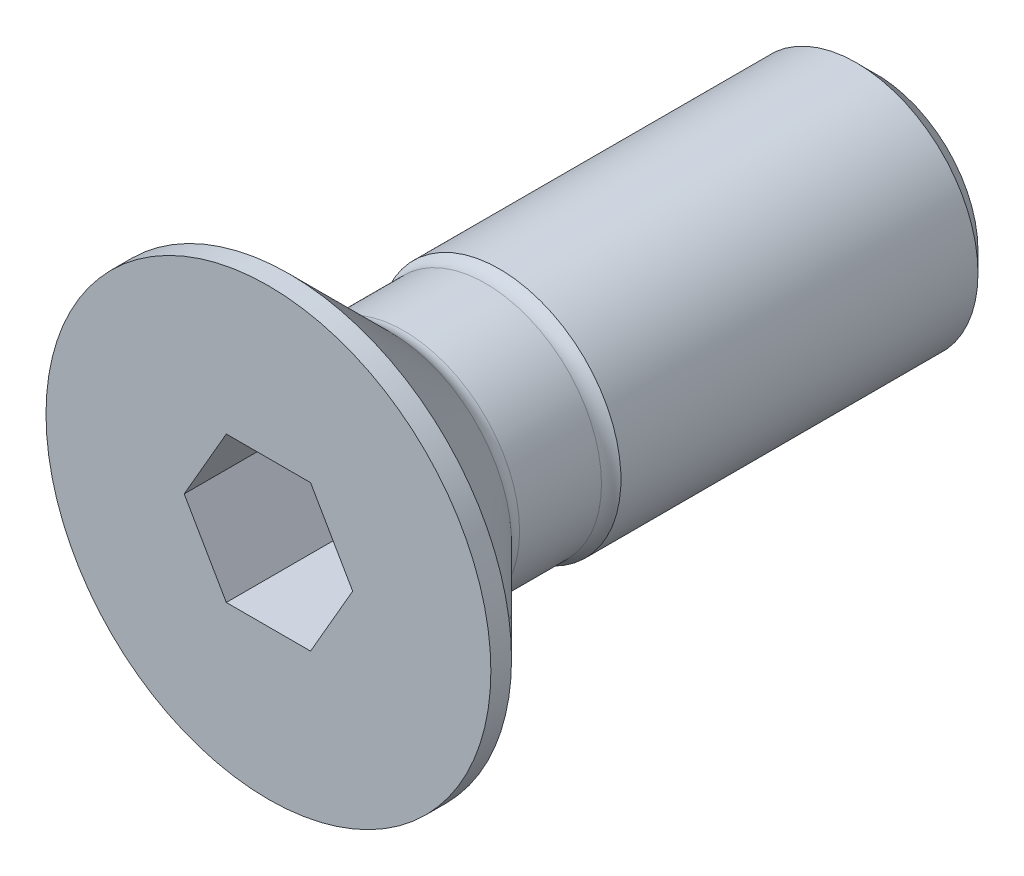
ISO-10303-21;
HEADER;
FILE_DESCRIPTION(('STEP AP214'),'2;1');
FILE_NAME('part.step','',(''),(''),'','','');
FILE_SCHEMA(('AUTOMOTIVE_DESIGN { 1 0 10303 214 1 1 1 1 }'));
ENDSEC;
DATA;
#1=APPLICATION_CONTEXT('core data for automotive mechanical design processes');
#2=APPLICATION_PROTOCOL_DEFINITION('international standard','automotive_design',2000,#1);
#3=PRODUCT_CONTEXT('',#1,'mechanical');
#4=PRODUCT('Part','Part','',(#3));
#5=PRODUCT_RELATED_PRODUCT_CATEGORY('part','',(#4));
#6=PRODUCT_DEFINITION_FORMATION('','',#4);
#7=PRODUCT_DEFINITION_CONTEXT('part definition',#1,'design');
#8=PRODUCT_DEFINITION('design','',#6,#7);
#9=PRODUCT_DEFINITION_SHAPE('','',#8);
#10=(LENGTH_UNIT() NAMED_UNIT(*) SI_UNIT(.MILLI.,.METRE.));
#11=(NAMED_UNIT(*) PLANE_ANGLE_UNIT() SI_UNIT($,.RADIAN.));
#12=(NAMED_UNIT(*) SI_UNIT($,.STERADIAN.) SOLID_ANGLE_UNIT());
#13=UNCERTAINTY_MEASURE_WITH_UNIT(LENGTH_MEASURE(1.E-05),#10,'distance_accuracy_value','');
#14=(GEOMETRIC_REPRESENTATION_CONTEXT(3) GLOBAL_UNCERTAINTY_ASSIGNED_CONTEXT((#13)) GLOBAL_UNIT_ASSIGNED_CONTEXT((#10,
#11,#12)) REPRESENTATION_CONTEXT('',''));
#15=CARTESIAN_POINT('',(0.,0.,0.));
#16=DIRECTION('',(0.,0.,1.));
#17=DIRECTION('',(1.,0.,0.));
#18=AXIS2_PLACEMENT_3D('',#15,#16,#17);
#19=CARTESIAN_POINT('',(0.,2.0940625,-25.));
#20=DIRECTION('',(0.,0.,-1.));
#21=DIRECTION('',(-1.,0.,0.));
#22=AXIS2_PLACEMENT_3D('',#19,#20,#21);
#23=PLANE('',#22);
#24=CARTESIAN_POINT('',(0.,0.,-24.9999999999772));
#25=DIRECTION('',(0.,0.,1.));
#26=DIRECTION('',(1.,0.,0.));
#27=AXIS2_PLACEMENT_3D('',#24,#25,#26);
#28=CIRCLE('',#27,4.18812499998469);
#29=CARTESIAN_POINT('',(4.18812499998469,0.,-24.9999999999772));
#30=VERTEX_POINT('',#29);
#31=EDGE_CURVE('E20',#30,#30,#28,.T.);
#32=ORIENTED_EDGE('',*,*,#31,.F.);
#33=EDGE_LOOP('',(#32));
#34=FACE_BOUND('',#33,.T.);
#35=ADVANCED_FACE('F16',(#34),#23,.T.);
#36=CARTESIAN_POINT('',(0.,0.,-24.1881250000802));
#37=DIRECTION('',(0.,0.,1.));
#38=DIRECTION('',(1.,0.,0.));
#39=AXIS2_PLACEMENT_3D('',#36,#37,#38);
#40=CONICAL_SURFACE('',#39,4.99999999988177,0.785398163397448);
#41=ORIENTED_EDGE('',*,*,#31,.T.);
#42=EDGE_LOOP('',(#41));
#43=FACE_BOUND('',#42,.T.);
#44=CARTESIAN_POINT('',(0.,0.,-24.188125));
#45=DIRECTION('',(0.,0.,-1.));
#46=DIRECTION('',(-1.,0.,0.));
#47=AXIS2_PLACEMENT_3D('',#44,#45,#46);
#48=CIRCLE('',#47,5.);
#49=CARTESIAN_POINT('',(-5.,0.,-24.188125));
#50=VERTEX_POINT('',#49);
#51=EDGE_CURVE('E154',#50,#50,#48,.F.);
#52=ORIENTED_EDGE('',*,*,#51,.F.);
#53=EDGE_LOOP('',(#52));
#54=FACE_BOUND('',#53,.T.);
#55=ADVANCED_FACE('F318',(#43,#54),#40,.T.);
#56=CARTESIAN_POINT('',(0.,0.,-16.8440625));
#57=DIRECTION('',(0.,0.,-1.));
#58=DIRECTION('',(-1.,0.,0.));
#59=AXIS2_PLACEMENT_3D('',#56,#57,#58);
#60=CYLINDRICAL_SURFACE('',#59,5.);
#61=ORIENTED_EDGE('',*,*,#51,.T.);
#62=EDGE_LOOP('',(#61));
#63=FACE_BOUND('',#62,.T.);
#64=CARTESIAN_POINT('',(0.,0.,-9.5));
#65=DIRECTION('',(0.,0.,-1.));
#66=DIRECTION('',(-1.,0.,0.));
#67=AXIS2_PLACEMENT_3D('',#64,#65,#66);
#68=CIRCLE('',#67,5.);
#69=CARTESIAN_POINT('',(-5.,0.,-9.5));
#70=VERTEX_POINT('',#69);
#71=EDGE_CURVE('E156',#70,#70,#68,.F.);
#72=ORIENTED_EDGE('',*,*,#71,.F.);
#73=EDGE_LOOP('',(#72));
#74=FACE_BOUND('',#73,.T.);
#75=ADVANCED_FACE('F260',(#63,#74),#60,.T.);
#76=CARTESIAN_POINT('',(0.,0.,-8.93431457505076));
#77=DIRECTION('',(0.,0.,-1.));
#78=DIRECTION('',(-1.,0.,0.));
#79=AXIS2_PLACEMENT_3D('',#76,#77,#78);
#80=TOROIDAL_SURFACE('',#79,5.56568542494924,0.8);
#81=CARTESIAN_POINT('',(0.,0.,-8.93431457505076));
#82=DIRECTION('',(0.,0.,-1.));
#83=DIRECTION('',(-1.,0.,0.));
#84=AXIS2_PLACEMENT_3D('',#81,#82,#83);
#85=CIRCLE('',#84,4.76568542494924);
#86=CARTESIAN_POINT('',(-4.76568542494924,0.,-8.93431457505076));
#87=VERTEX_POINT('',#86);
#88=EDGE_CURVE('E246',#87,#87,#85,.F.);
#89=ORIENTED_EDGE('',*,*,#88,.F.);
#90=EDGE_LOOP('',(#89));
#91=FACE_BOUND('',#90,.T.);
#92=ORIENTED_EDGE('',*,*,#71,.T.);
#93=EDGE_LOOP('',(#92));
#94=FACE_BOUND('',#93,.T.);
#95=ADVANCED_FACE('F257',(#91,#94),#80,.F.);
#96=CARTESIAN_POINT('',(0.,0.,-7.25));
#97=DIRECTION('',(0.,0.,-1.));
#98=DIRECTION('',(-1.,0.,0.));
#99=AXIS2_PLACEMENT_3D('',#96,#97,#98);
#100=CYLINDRICAL_SURFACE('',#99,4.76568542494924);
#101=ORIENTED_EDGE('',*,*,#88,.T.);
#102=EDGE_LOOP('',(#101));
#103=FACE_BOUND('',#102,.T.);
#104=CARTESIAN_POINT('',(0.,0.,-5.56568542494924));
#105=DIRECTION('',(0.,0.,-1.));
#106=DIRECTION('',(-1.,0.,0.));
#107=AXIS2_PLACEMENT_3D('',#104,#105,#106);
#108=CIRCLE('',#107,4.76568542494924);
#109=CARTESIAN_POINT('',(-4.76568542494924,0.,-5.56568542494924));
#110=VERTEX_POINT('',#109);
#111=EDGE_CURVE('E99',#110,#110,#108,.F.);
#112=ORIENTED_EDGE('',*,*,#111,.F.);
#113=EDGE_LOOP('',(#112));
#114=FACE_BOUND('',#113,.T.);
#115=ADVANCED_FACE('F242',(#103,#114),#100,.T.);
#116=CARTESIAN_POINT('',(0.,0.,-5.56568542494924));
#117=DIRECTION('',(0.,0.,-1.));
#118=DIRECTION('',(-1.,0.,0.));
#119=AXIS2_PLACEMENT_3D('',#116,#117,#118);
#120=TOROIDAL_SURFACE('',#119,5.56568542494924,0.8);
#121=CARTESIAN_POINT('',(0.,0.,-5.));
#122=DIRECTION('',(0.,0.,1.));
#123=DIRECTION('',(0.,1.,0.));
#124=AXIS2_PLACEMENT_3D('',#121,#122,#123);
#125=CIRCLE('',#124,5.);
#126=CARTESIAN_POINT('',(0.,5.,-5.));
#127=VERTEX_POINT('',#126);
#128=EDGE_CURVE('E81',#127,#127,#125,.T.);
#129=ORIENTED_EDGE('',*,*,#128,.F.);
#130=EDGE_LOOP('',(#129));
#131=FACE_BOUND('',#130,.T.);
#132=ORIENTED_EDGE('',*,*,#111,.T.);
#133=EDGE_LOOP('',(#132));
#134=FACE_BOUND('',#133,.T.);
#135=ADVANCED_FACE('F176',(#131,#134),#120,.F.);
#136=CARTESIAN_POINT('',(0.,0.,-4.48799688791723));
#137=DIRECTION('',(0.,0.,1.));
#138=DIRECTION('',(1.,0.,0.));
#139=AXIS2_PLACEMENT_3D('',#136,#137,#138);
#140=CONICAL_SURFACE('',#139,3.48578999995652,1.04719755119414);
#141=CARTESIAN_POINT('',(3.46499999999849,2.61771186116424E-12,-4.49999999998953));
#142=CARTESIAN_POINT('',(3.38886711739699,0.131866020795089,-4.543968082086));
#143=CARTESIAN_POINT('',(3.31207705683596,0.264870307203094,-4.58395475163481));
#144=CARTESIAN_POINT('',(3.15716736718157,0.533181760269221,-4.65375028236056));
#145=CARTESIAN_POINT('',(3.0790449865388,0.668493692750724,-4.68353445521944));
#146=CARTESIAN_POINT('',(2.92376835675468,0.937440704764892,-4.72989566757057));
#147=CARTESIAN_POINT('',(2.84663799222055,1.0710344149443,-4.74678130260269));
#148=CARTESIAN_POINT('',(2.69201452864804,1.33885010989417,-4.76693545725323));
#149=CARTESIAN_POINT('',(2.61452199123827,1.47307112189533,-4.77022067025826));
#150=CARTESIAN_POINT('',(2.46973549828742,1.72384868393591,-4.76336884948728));
#151=CARTESIAN_POINT('',(2.40241981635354,1.84044286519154,-4.75491416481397));
#152=CARTESIAN_POINT('',(2.26822699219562,2.07287165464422,-4.72812319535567));
#153=CARTESIAN_POINT('',(2.2013503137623,2.18870545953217,-4.70977776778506));
#154=CARTESIAN_POINT('',(2.06688103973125,2.42161307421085,-4.66391774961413));
#155=CARTESIAN_POINT('',(1.99930545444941,2.53865742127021,-4.63620885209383));
#156=CARTESIAN_POINT('',(1.86516188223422,2.77100090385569,-4.57332136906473));
#157=CARTESIAN_POINT('',(1.79859217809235,2.88630301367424,-4.53815755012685));
#158=CARTESIAN_POINT('',(1.73250000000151,3.00077802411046,-4.49999999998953));
#159=B_SPLINE_CURVE_WITH_KNOTS('',3,(#141,#142,#143,#144,#145,#146,#147,#148,#149,#150,#151,
#152,#153,#154,#155,#156,#157,#158),.UNSPECIFIED.,.F.,.F.,(4,2,2,2,2,2,2,2,4),(0.,
0.475647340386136,0.952437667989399,1.41742891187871,1.88184924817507,2.28615441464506,
2.69083395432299,3.1044873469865,3.51732891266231),.UNSPECIFIED.);
#160=CARTESIAN_POINT('',(3.46499999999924,-1.30917788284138E-12,-4.49999999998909));
#161=VERTEX_POINT('',#160);
#162=CARTESIAN_POINT('',(1.73249999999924,3.00077802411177,-4.49999999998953));
#163=VERTEX_POINT('',#162);
#164=EDGE_CURVE('E117',#161,#163,#159,.T.);
#165=ORIENTED_EDGE('',*,*,#164,.T.);
#166=CARTESIAN_POINT('',(1.73249999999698,3.00077802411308,-4.49999999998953));
#167=CARTESIAN_POINT('',(1.59027892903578,3.00077802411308,-4.5410599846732));
#168=CARTESIAN_POINT('',(1.44693276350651,3.00077802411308,-4.57865156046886));
#169=CARTESIAN_POINT('',(1.15791187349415,3.00077802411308,-4.64509000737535));
#170=CARTESIAN_POINT('',(1.01223269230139,3.00077802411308,-4.67391731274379));
#171=CARTESIAN_POINT('',(0.722508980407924,3.00077802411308,-4.72027510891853));
#172=CARTESIAN_POINT('',(0.578505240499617,3.00077802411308,-4.73805276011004));
#173=CARTESIAN_POINT('',(0.289666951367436,3.00077802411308,-4.76191820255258));
#174=CARTESIAN_POINT('',(0.144833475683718,3.00077802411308,-4.76801868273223));
#175=CARTESIAN_POINT('',(-0.144833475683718,3.00077802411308,-4.76801868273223));
#176=CARTESIAN_POINT('',(-0.289666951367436,3.00077802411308,-4.76191820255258));
#177=CARTESIAN_POINT('',(-0.578505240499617,3.00077802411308,-4.73805276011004));
#178=CARTESIAN_POINT('',(-0.722508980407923,3.00077802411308,-4.72027510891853));
#179=CARTESIAN_POINT('',(-1.01223269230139,3.00077802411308,-4.67391731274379));
#180=CARTESIAN_POINT('',(-1.15791187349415,3.00077802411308,-4.64509000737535));
#181=CARTESIAN_POINT('',(-1.44693276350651,3.00077802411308,-4.57865156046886));
#182=CARTESIAN_POINT('',(-1.59027892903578,3.00077802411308,-4.5410599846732));
#183=CARTESIAN_POINT('',(-1.73249999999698,3.00077802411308,-4.49999999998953));
#184=B_SPLINE_CURVE_WITH_KNOTS('',3,(#166,#167,#168,#169,#170,#171,#172,#173,#174,#175,#176,
#177,#178,#179,#180,#181,#182,#183),.UNSPECIFIED.,.F.,.F.,(4,2,2,2,2,2,2,2,4),(0.,
0.444225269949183,0.8894350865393,1.32428964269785,1.7586713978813,2.19305315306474,
2.62790770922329,3.07311752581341,3.51734279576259),.UNSPECIFIED.);
#185=CARTESIAN_POINT('',(-1.73249999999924,3.00077802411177,-4.49999999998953));
#186=VERTEX_POINT('',#185);
#187=EDGE_CURVE('E113',#163,#186,#184,.T.);
#188=ORIENTED_EDGE('',*,*,#187,.T.);
#189=CARTESIAN_POINT('',(-1.73250000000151,3.00077802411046,-4.49999999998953));
#190=CARTESIAN_POINT('',(-1.80863288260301,2.86891200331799,-4.543968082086));
#191=CARTESIAN_POINT('',(-1.88542294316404,2.73590771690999,-4.58395475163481));
#192=CARTESIAN_POINT('',(-2.04033263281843,2.46759626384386,-4.65375028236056));
#193=CARTESIAN_POINT('',(-2.1184550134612,2.33228433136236,-4.68353445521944));
#194=CARTESIAN_POINT('',(-2.27373164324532,2.06333731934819,-4.72989566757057));
#195=CARTESIAN_POINT('',(-2.35086200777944,1.92974360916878,-4.74678130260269));
#196=CARTESIAN_POINT('',(-2.50548547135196,1.66192791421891,-4.76693545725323));
#197=CARTESIAN_POINT('',(-2.58297800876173,1.52770690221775,-4.77022067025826));
#198=CARTESIAN_POINT('',(-2.72776450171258,1.27692934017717,-4.76336884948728));
#199=CARTESIAN_POINT('',(-2.79508018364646,1.16033515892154,-4.75491416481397));
#200=CARTESIAN_POINT('',(-2.92927300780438,0.927906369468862,-4.72812319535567));
#201=CARTESIAN_POINT('',(-2.9961496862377,0.81207256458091,-4.70977776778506));
#202=CARTESIAN_POINT('',(-3.13061896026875,0.57916494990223,-4.66391774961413));
#203=CARTESIAN_POINT('',(-3.19819454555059,0.462120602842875,-4.63620885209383));
#204=CARTESIAN_POINT('',(-3.33233811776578,0.229777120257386,-4.57332136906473));
#205=CARTESIAN_POINT('',(-3.39890782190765,0.114475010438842,-4.53815755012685));
#206=CARTESIAN_POINT('',(-3.46499999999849,2.61811792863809E-12,-4.49999999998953));
#207=B_SPLINE_CURVE_WITH_KNOTS('',3,(#189,#190,#191,#192,#193,#194,#195,#196,#197,#198,#199,
#200,#201,#202,#203,#204,#205,#206),.UNSPECIFIED.,.F.,.F.,(4,2,2,2,2,2,2,2,4),(0.,
0.475647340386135,0.952437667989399,1.41742891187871,1.88184924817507,2.28615441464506,
2.69083395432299,3.1044873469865,3.51732891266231),.UNSPECIFIED.);
#208=CARTESIAN_POINT('',(-3.46499999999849,0.,-4.49999999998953));
#209=VERTEX_POINT('',#208);
#210=EDGE_CURVE('E108',#186,#209,#207,.T.);
#211=ORIENTED_EDGE('',*,*,#210,.T.);
#212=CARTESIAN_POINT('',(-3.46499999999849,-2.61766510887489E-12,-4.49999999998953));
#213=CARTESIAN_POINT('',(-3.38886711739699,-0.131866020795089,-4.543968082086));
#214=CARTESIAN_POINT('',(-3.31207705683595,-0.264870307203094,-4.58395475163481));
#215=CARTESIAN_POINT('',(-3.15716736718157,-0.53318176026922,-4.65375028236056));
#216=CARTESIAN_POINT('',(-3.0790449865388,-0.668493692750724,-4.68353445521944));
#217=CARTESIAN_POINT('',(-2.92376835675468,-0.937440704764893,-4.72989566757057));
#218=CARTESIAN_POINT('',(-2.84663799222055,-1.0710344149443,-4.74678130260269));
#219=CARTESIAN_POINT('',(-2.69201452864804,-1.33885010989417,-4.76693545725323));
#220=CARTESIAN_POINT('',(-2.61452199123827,-1.47307112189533,-4.77022067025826));
#221=CARTESIAN_POINT('',(-2.46973549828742,-1.72384868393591,-4.76336884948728));
#222=CARTESIAN_POINT('',(-2.40241981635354,-1.84044286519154,-4.75491416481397));
#223=CARTESIAN_POINT('',(-2.26822699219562,-2.07287165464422,-4.72812319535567));
#224=CARTESIAN_POINT('',(-2.2013503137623,-2.18870545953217,-4.70977776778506));
#225=CARTESIAN_POINT('',(-2.06688103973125,-2.42161307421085,-4.66391774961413));
#226=CARTESIAN_POINT('',(-1.99930545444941,-2.5386574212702,-4.63620885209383));
#227=CARTESIAN_POINT('',(-1.86516188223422,-2.77100090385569,-4.57332136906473));
#228=CARTESIAN_POINT('',(-1.79859217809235,-2.88630301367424,-4.53815755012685));
#229=CARTESIAN_POINT('',(-1.73250000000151,-3.00077802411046,-4.49999999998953));
#230=B_SPLINE_CURVE_WITH_KNOTS('',3,(#212,#213,#214,#215,#216,#217,#218,#219,#220,#221,#222,
#223,#224,#225,#226,#227,#228,#229),.UNSPECIFIED.,.F.,.F.,(4,2,2,2,2,2,2,2,4),(0.,
0.475647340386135,0.952437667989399,1.41742891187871,1.88184924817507,2.28615441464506,
2.69083395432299,3.10448734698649,3.51732891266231),.UNSPECIFIED.);
#231=CARTESIAN_POINT('',(-1.73249999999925,-3.00077802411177,-4.49999999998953));
#232=VERTEX_POINT('',#231);
#233=EDGE_CURVE('E87',#209,#232,#230,.T.);
#234=ORIENTED_EDGE('',*,*,#233,.T.);
#235=CARTESIAN_POINT('',(-1.73249999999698,-3.00077802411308,-4.49999999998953));
#236=CARTESIAN_POINT('',(-1.59027892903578,-3.00077802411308,-4.5410599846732));
#237=CARTESIAN_POINT('',(-1.44693276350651,-3.00077802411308,-4.57865156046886));
#238=CARTESIAN_POINT('',(-1.15791187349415,-3.00077802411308,-4.64509000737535));
#239=CARTESIAN_POINT('',(-1.01223269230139,-3.00077802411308,-4.67391731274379));
#240=CARTESIAN_POINT('',(-0.722508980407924,-3.00077802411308,-4.72027510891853));
#241=CARTESIAN_POINT('',(-0.578505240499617,-3.00077802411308,-4.73805276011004));
#242=CARTESIAN_POINT('',(-0.289666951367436,-3.00077802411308,-4.76191820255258));
#243=CARTESIAN_POINT('',(-0.144833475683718,-3.00077802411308,-4.76801868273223));
#244=CARTESIAN_POINT('',(0.144833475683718,-3.00077802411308,-4.76801868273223));
#245=CARTESIAN_POINT('',(0.289666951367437,-3.00077802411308,-4.76191820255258));
#246=CARTESIAN_POINT('',(0.578505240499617,-3.00077802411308,-4.73805276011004));
#247=CARTESIAN_POINT('',(0.722508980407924,-3.00077802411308,-4.72027510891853));
#248=CARTESIAN_POINT('',(1.01223269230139,-3.00077802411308,-4.67391731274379));
#249=CARTESIAN_POINT('',(1.15791187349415,-3.00077802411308,-4.64509000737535));
#250=CARTESIAN_POINT('',(1.44693276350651,-3.00077802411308,-4.57865156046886));
#251=CARTESIAN_POINT('',(1.59027892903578,-3.00077802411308,-4.5410599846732));
#252=CARTESIAN_POINT('',(1.73249999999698,-3.00077802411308,-4.49999999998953));
#253=B_SPLINE_CURVE_WITH_KNOTS('',3,(#235,#236,#237,#238,#239,#240,#241,#242,#243,#244,#245,
#246,#247,#248,#249,#250,#251,#252),.UNSPECIFIED.,.F.,.F.,(4,2,2,2,2,2,2,2,4),(0.,
0.444225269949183,0.8894350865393,1.32428964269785,1.7586713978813,2.19305315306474,
2.62790770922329,3.07311752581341,3.51734279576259),.UNSPECIFIED.);
#254=CARTESIAN_POINT('',(1.73249999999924,-3.00077802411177,-4.49999999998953));
#255=VERTEX_POINT('',#254);
#256=EDGE_CURVE('E83',#232,#255,#253,.T.);
#257=ORIENTED_EDGE('',*,*,#256,.T.);
#258=CARTESIAN_POINT('',(1.73250000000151,-3.00077802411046,-4.49999999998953));
#259=CARTESIAN_POINT('',(1.80863288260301,-2.86891200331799,-4.543968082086));
#260=CARTESIAN_POINT('',(1.88542294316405,-2.73590771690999,-4.58395475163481));
#261=CARTESIAN_POINT('',(2.04033263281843,-2.46759626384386,-4.65375028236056));
#262=CARTESIAN_POINT('',(2.1184550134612,-2.33228433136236,-4.68353445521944));
#263=CARTESIAN_POINT('',(2.27373164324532,-2.06333731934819,-4.72989566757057));
#264=CARTESIAN_POINT('',(2.35086200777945,-1.92974360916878,-4.74678130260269));
#265=CARTESIAN_POINT('',(2.50548547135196,-1.66192791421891,-4.76693545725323));
#266=CARTESIAN_POINT('',(2.58297800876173,-1.52770690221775,-4.77022067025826));
#267=CARTESIAN_POINT('',(2.72776450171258,-1.27692934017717,-4.76336884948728));
#268=CARTESIAN_POINT('',(2.79508018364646,-1.16033515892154,-4.75491416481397));
#269=CARTESIAN_POINT('',(2.92927300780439,-0.927906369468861,-4.72812319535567));
#270=CARTESIAN_POINT('',(2.9961496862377,-0.81207256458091,-4.70977776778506));
#271=CARTESIAN_POINT('',(3.13061896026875,-0.57916494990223,-4.66391774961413));
#272=CARTESIAN_POINT('',(3.19819454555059,-0.462120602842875,-4.63620885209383));
#273=CARTESIAN_POINT('',(3.33233811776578,-0.229777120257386,-4.57332136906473));
#274=CARTESIAN_POINT('',(3.39890782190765,-0.114475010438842,-4.53815755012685));
#275=CARTESIAN_POINT('',(3.46499999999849,-2.61825516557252E-12,-4.49999999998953));
#276=B_SPLINE_CURVE_WITH_KNOTS('',3,(#258,#259,#260,#261,#262,#263,#264,#265,#266,#267,#268,
#269,#270,#271,#272,#273,#274,#275),.UNSPECIFIED.,.F.,.F.,(4,2,2,2,2,2,2,2,4),(0.,
0.475647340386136,0.952437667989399,1.41742891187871,1.88184924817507,2.28615441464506,
2.69083395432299,3.1044873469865,3.51732891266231),.UNSPECIFIED.);
#277=EDGE_CURVE('E69',#255,#161,#276,.T.);
#278=ORIENTED_EDGE('',*,*,#277,.T.);
#279=EDGE_LOOP('',(#165,#188,#211,#234,#257,#278));
#280=FACE_BOUND('',#279,.T.);
#281=CARTESIAN_POINT('',(0.,1.13686837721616E-10,-6.50051868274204));
#282=VERTEX_POINT('',#281);
#283=VERTEX_LOOP('',#282);
#284=FACE_BOUND('',#283,.T.);
#285=ADVANCED_FACE('F84',(#280,#284),#140,.F.);
#286=CARTESIAN_POINT('',(0.,0.,-0.85));
#287=DIRECTION('',(0.,0.,1.));
#288=DIRECTION('',(1.,0.,0.));
#289=AXIS2_PLACEMENT_3D('',#286,#287,#288);
#290=CONICAL_SURFACE('',#289,9.15,0.785398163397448);
#291=ORIENTED_EDGE('',*,*,#128,.T.);
#292=EDGE_LOOP('',(#291));
#293=FACE_BOUND('',#292,.T.);
#294=CARTESIAN_POINT('',(0.,0.,-0.849999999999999));
#295=DIRECTION('',(0.,0.,-1.));
#296=DIRECTION('',(-1.,0.,0.));
#297=AXIS2_PLACEMENT_3D('',#294,#295,#296);
#298=CIRCLE('',#297,9.15);
#299=CARTESIAN_POINT('',(-9.15,0.,-0.849999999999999));
#300=VERTEX_POINT('',#299);
#301=EDGE_CURVE('E123',#300,#300,#298,.F.);
#302=ORIENTED_EDGE('',*,*,#301,.F.);
#303=EDGE_LOOP('',(#302));
#304=FACE_BOUND('',#303,.T.);
#305=ADVANCED_FACE('F175',(#293,#304),#290,.T.);
#306=CARTESIAN_POINT('',(1.7325,-3.00077802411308,0.));
#307=DIRECTION('',(0.866025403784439,-0.5,0.));
#308=DIRECTION('',(0.5,0.866025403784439,0.));
#309=AXIS2_PLACEMENT_3D('',#306,#307,#308);
#310=PLANE('',#309);
#311=DIRECTION('',(0.,0.,1.));
#312=VECTOR('',#311,1.);
#313=CARTESIAN_POINT('',(1.7325,-3.00077802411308,0.));
#314=LINE('',#313,#312);
#315=CARTESIAN_POINT('',(1.7325,-3.00077802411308,0.));
#316=VERTEX_POINT('',#315);
#317=EDGE_CURVE('E74',#255,#316,#314,.T.);
#318=ORIENTED_EDGE('',*,*,#317,.T.);
#319=DIRECTION('',(-0.5,-0.866025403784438,0.));
#320=VECTOR('',#319,1.);
#321=CARTESIAN_POINT('',(3.465,0.,0.));
#322=LINE('',#321,#320);
#323=CARTESIAN_POINT('',(3.465,0.,0.));
#324=VERTEX_POINT('',#323);
#325=EDGE_CURVE('E126',#324,#316,#322,.T.);
#326=ORIENTED_EDGE('',*,*,#325,.F.);
#327=DIRECTION('',(0.,0.,1.));
#328=VECTOR('',#327,1.);
#329=CARTESIAN_POINT('',(3.465,0.,0.));
#330=LINE('',#329,#328);
#331=EDGE_CURVE('E77',#324,#161,#330,.F.);
#332=ORIENTED_EDGE('',*,*,#331,.T.);
#333=ORIENTED_EDGE('',*,*,#277,.F.);
#334=EDGE_LOOP('',(#318,#326,#332,#333));
#335=FACE_BOUND('',#334,.T.);
#336=ADVANCED_FACE('F71',(#335),#310,.F.);
#337=CARTESIAN_POINT('',(-1.7325,-3.00077802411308,0.));
#338=DIRECTION('',(0.,-1.,0.));
#339=DIRECTION('',(1.,0.,0.));
#340=AXIS2_PLACEMENT_3D('',#337,#338,#339);
#341=PLANE('',#340);
#342=ORIENTED_EDGE('',*,*,#256,.F.);
#343=DIRECTION('',(0.,0.,1.));
#344=VECTOR('',#343,1.);
#345=CARTESIAN_POINT('',(-1.7325,-3.00077802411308,0.));
#346=LINE('',#345,#344);
#347=CARTESIAN_POINT('',(-1.7325,-3.00077802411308,0.));
#348=VERTEX_POINT('',#347);
#349=EDGE_CURVE('E90',#232,#348,#346,.T.);
#350=ORIENTED_EDGE('',*,*,#349,.T.);
#351=DIRECTION('',(1.,0.,0.));
#352=VECTOR('',#351,1.);
#353=CARTESIAN_POINT('',(0.,-3.00077802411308,0.));
#354=LINE('',#353,#352);
#355=EDGE_CURVE('E94',#316,#348,#354,.F.);
#356=ORIENTED_EDGE('',*,*,#355,.F.);
#357=ORIENTED_EDGE('',*,*,#317,.F.);
#358=EDGE_LOOP('',(#342,#350,#356,#357));
#359=FACE_BOUND('',#358,.T.);
#360=ADVANCED_FACE('F92',(#359),#341,.F.);
#361=CARTESIAN_POINT('',(-3.465,0.,0.));
#362=DIRECTION('',(-0.866025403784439,-0.5,0.));
#363=DIRECTION('',(0.5,-0.866025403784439,0.));
#364=AXIS2_PLACEMENT_3D('',#361,#362,#363);
#365=PLANE('',#364);
#366=DIRECTION('',(0.,0.,1.));
#367=VECTOR('',#366,1.);
#368=CARTESIAN_POINT('',(-3.465,0.,0.));
#369=LINE('',#368,#367);
#370=CARTESIAN_POINT('',(-3.465,0.,0.));
#371=VERTEX_POINT('',#370);
#372=EDGE_CURVE('E106',#209,#371,#369,.T.);
#373=ORIENTED_EDGE('',*,*,#372,.T.);
#374=DIRECTION('',(-0.5,0.866025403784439,0.));
#375=VECTOR('',#374,1.);
#376=CARTESIAN_POINT('',(-1.7325,-3.00077802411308,0.));
#377=LINE('',#376,#375);
#378=EDGE_CURVE('E142',#348,#371,#377,.T.);
#379=ORIENTED_EDGE('',*,*,#378,.F.);
#380=ORIENTED_EDGE('',*,*,#349,.F.);
#381=ORIENTED_EDGE('',*,*,#233,.F.);
#382=EDGE_LOOP('',(#373,#379,#380,#381));
#383=FACE_BOUND('',#382,.T.);
#384=ADVANCED_FACE('F197',(#383),#365,.F.);
#385=CARTESIAN_POINT('',(-1.7325,3.00077802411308,0.));
#386=DIRECTION('',(-0.866025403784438,0.5,0.));
#387=DIRECTION('',(-0.5,-0.866025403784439,0.));
#388=AXIS2_PLACEMENT_3D('',#385,#386,#387);
#389=PLANE('',#388);
#390=DIRECTION('',(0.,0.,1.));
#391=VECTOR('',#390,1.);
#392=CARTESIAN_POINT('',(-1.7325,3.00077802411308,0.));
#393=LINE('',#392,#391);
#394=CARTESIAN_POINT('',(-1.7325,3.00077802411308,0.));
#395=VERTEX_POINT('',#394);
#396=EDGE_CURVE('E111',#186,#395,#393,.T.);
#397=ORIENTED_EDGE('',*,*,#396,.T.);
#398=DIRECTION('',(0.5,0.866025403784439,0.));
#399=VECTOR('',#398,1.);
#400=CARTESIAN_POINT('',(-3.465,0.,0.));
#401=LINE('',#400,#399);
#402=EDGE_CURVE('E137',#371,#395,#401,.T.);
#403=ORIENTED_EDGE('',*,*,#402,.F.);
#404=ORIENTED_EDGE('',*,*,#372,.F.);
#405=ORIENTED_EDGE('',*,*,#210,.F.);
#406=EDGE_LOOP('',(#397,#403,#404,#405));
#407=FACE_BOUND('',#406,.T.);
#408=ADVANCED_FACE('F200',(#407),#389,.F.);
#409=CARTESIAN_POINT('',(1.7325,3.00077802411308,0.));
#410=DIRECTION('',(0.,1.,0.));
#411=DIRECTION('',(0.,0.,1.));
#412=AXIS2_PLACEMENT_3D('',#409,#410,#411);
#413=PLANE('',#412);
#414=ORIENTED_EDGE('',*,*,#187,.F.);
#415=DIRECTION('',(0.,0.,1.));
#416=VECTOR('',#415,1.);
#417=CARTESIAN_POINT('',(1.7325,3.00077802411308,0.));
#418=LINE('',#417,#416);
#419=CARTESIAN_POINT('',(1.7325,3.00077802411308,0.));
#420=VERTEX_POINT('',#419);
#421=EDGE_CURVE('E35',#163,#420,#418,.T.);
#422=ORIENTED_EDGE('',*,*,#421,.T.);
#423=DIRECTION('',(1.,0.,0.));
#424=VECTOR('',#423,1.);
#425=CARTESIAN_POINT('',(0.,3.00077802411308,0.));
#426=LINE('',#425,#424);
#427=EDGE_CURVE('E132',#395,#420,#426,.T.);
#428=ORIENTED_EDGE('',*,*,#427,.F.);
#429=ORIENTED_EDGE('',*,*,#396,.F.);
#430=EDGE_LOOP('',(#414,#422,#428,#429));
#431=FACE_BOUND('',#430,.T.);
#432=ADVANCED_FACE('F205',(#431),#413,.F.);
#433=CARTESIAN_POINT('',(3.465,0.,0.));
#434=DIRECTION('',(0.866025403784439,0.5,0.));
#435=DIRECTION('',(-0.5,0.866025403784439,0.));
#436=AXIS2_PLACEMENT_3D('',#433,#434,#435);
#437=PLANE('',#436);
#438=ORIENTED_EDGE('',*,*,#331,.F.);
#439=DIRECTION('',(0.5,-0.866025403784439,0.));
#440=VECTOR('',#439,1.);
#441=CARTESIAN_POINT('',(1.7325,3.00077802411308,0.));
#442=LINE('',#441,#440);
#443=EDGE_CURVE('E26',#420,#324,#442,.T.);
#444=ORIENTED_EDGE('',*,*,#443,.F.);
#445=ORIENTED_EDGE('',*,*,#421,.F.);
#446=ORIENTED_EDGE('',*,*,#164,.F.);
#447=EDGE_LOOP('',(#438,#444,#445,#446));
#448=FACE_BOUND('',#447,.T.);
#449=ADVANCED_FACE('F169',(#448),#437,.F.);
#450=CARTESIAN_POINT('',(0.,0.,-0.424999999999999));
#451=DIRECTION('',(0.,0.,-1.));
#452=DIRECTION('',(-1.,0.,0.));
#453=AXIS2_PLACEMENT_3D('',#450,#451,#452);
#454=CYLINDRICAL_SURFACE('',#453,9.15);
#455=ORIENTED_EDGE('',*,*,#301,.T.);
#456=EDGE_LOOP('',(#455));
#457=FACE_BOUND('',#456,.T.);
#458=CARTESIAN_POINT('',(0.,0.,0.));
#459=DIRECTION('',(0.,0.,-1.));
#460=DIRECTION('',(-1.,0.,0.));
#461=AXIS2_PLACEMENT_3D('',#458,#459,#460);
#462=CIRCLE('',#461,9.15);
#463=CARTESIAN_POINT('',(-9.15,0.,0.));
#464=VERTEX_POINT('',#463);
#465=EDGE_CURVE('E10',#464,#464,#462,.F.);
#466=ORIENTED_EDGE('',*,*,#465,.F.);
#467=EDGE_LOOP('',(#466));
#468=FACE_BOUND('',#467,.T.);
#469=ADVANCED_FACE('F213',(#457,#468),#454,.T.);
#470=CARTESIAN_POINT('',(0.,4.575,0.));
#471=DIRECTION('',(0.,0.,1.));
#472=DIRECTION('',(0.,-1.,0.));
#473=AXIS2_PLACEMENT_3D('',#470,#471,#472);
#474=PLANE('',#473);
#475=ORIENTED_EDGE('',*,*,#465,.T.);
#476=EDGE_LOOP('',(#475));
#477=FACE_BOUND('',#476,.T.);
#478=ORIENTED_EDGE('',*,*,#427,.T.);
#479=ORIENTED_EDGE('',*,*,#443,.T.);
#480=ORIENTED_EDGE('',*,*,#325,.T.);
#481=ORIENTED_EDGE('',*,*,#355,.T.);
#482=ORIENTED_EDGE('',*,*,#378,.T.);
#483=ORIENTED_EDGE('',*,*,#402,.T.);
#484=EDGE_LOOP('',(#478,#479,#480,#481,#482,#483));
#485=FACE_BOUND('',#484,.T.);
#486=ADVANCED_FACE('F18',(#477,#485),#474,.T.);
#487=CLOSED_SHELL('',(#35,#55,#75,#95,#115,#135,#285,#305,#336,#360,#384,#408,#432,#449,#469,#486));
#488=MANIFOLD_SOLID_BREP('B1',#487);
#489=ADVANCED_BREP_SHAPE_REPRESENTATION('',(#18,#488),#14);
#490=SHAPE_DEFINITION_REPRESENTATION(#9,#489);
ENDSEC;
END-ISO-10303-21;
